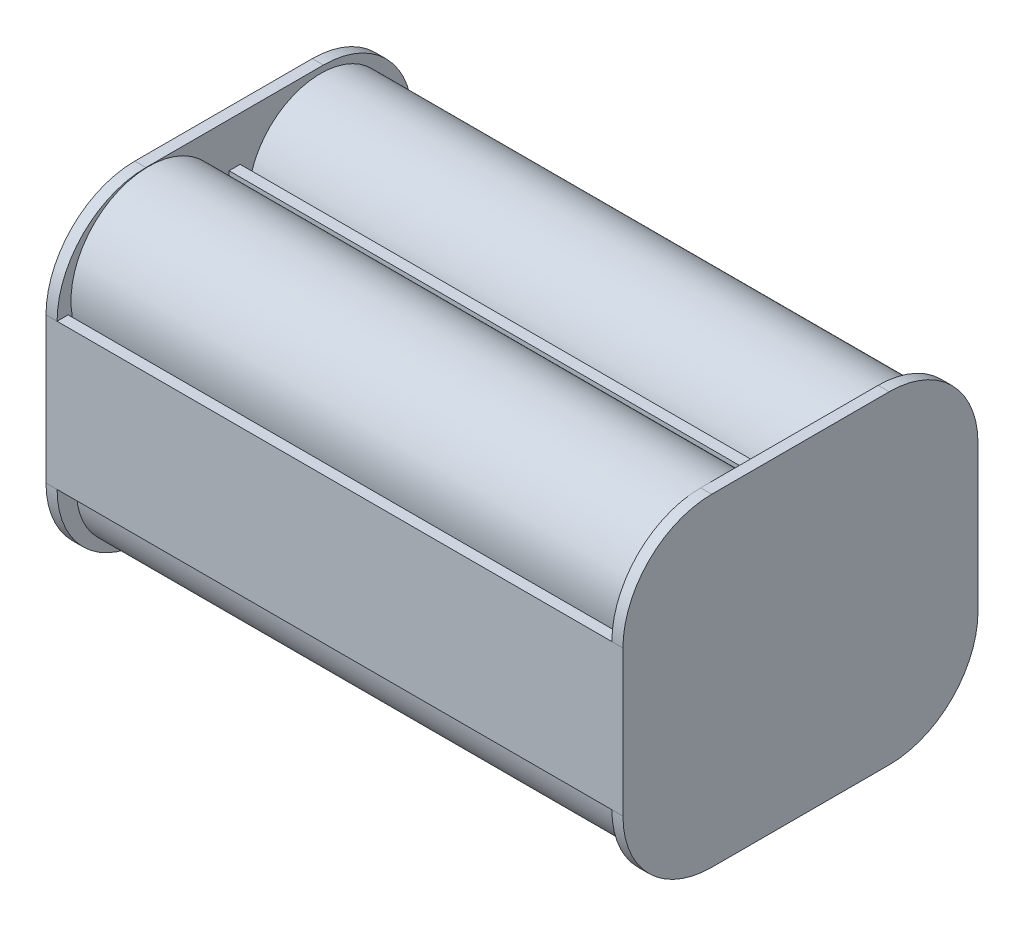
from build123d import *

# Parameters (mm, degrees)
RESSALTO_EXTRUS_O1_DEPTH  = 1
RESSALTO_EXTRUS_O2_DEPTH  = 50
ESBO_O3_R                 = 7
RESSALTO_EXTRUS_O5_DEPTH  = 50
ESBO_O7_R                 = 6.5
RESSALTO_EXTRUS_O9_DEPTH  = 50
ESBO_O8_R                 = 6.5
RESSALTO_EXTRUS_O10_DEPTH = 50
ESBO_O9_R                 = 6.5
RESSALTO_EXTRUS_O11_DEPTH = 50
RESSALTO_EXTRUS_O12_DEPTH = 1


with BuildPart() as part:
    # Esbo_o1 → Ressalto-extrus_o1 (new body)
    with BuildSketch(Plane(origin=(0, 0, 0), x_dir=(0, 0, -1), z_dir=(1, 0, 0))):
        with BuildLine():
            Line((-5.303370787, 18.696629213), (10.696629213, 18.696629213))
            ThreePointArc((10.696629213, 18.696629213), (16.353483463, 16.353483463), (18.696629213, 10.696629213))
            Line((18.696629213, 10.696629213), (18.696629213, -2.426966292))
            ThreePointArc((18.696629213, -2.426966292), (16.353483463, -8.083820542), (10.696629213, -10.426966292))
            Line((10.696629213, -10.426966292), (-5.303370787, -10.426966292))
            ThreePointArc((-5.303370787, -10.426966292), (-10.960225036, -8.083820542), (-13.303370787, -2.426966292))
            Line((-13.303370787, -2.426966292), (-13.303370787, 10.696629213))
            ThreePointArc((-13.303370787, 10.696629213), (-10.960225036, 16.353483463), (-5.303370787, 18.696629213))
        make_face()
    extrude(amount=RESSALTO_EXTRUS_O1_DEPTH)

    # Esbo_o2 → Ressalto-extrus_o2 (add)
    with BuildSketch(Plane(origin=(1, 0, 0), x_dir=(0, 0, -1), z_dir=(1, 0, 0))):
        Polygon((18.696629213, -2.426966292), (18.696629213, 4.134831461), (18.696629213, 4.634831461), (18.696629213, 10.696629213), (17.696629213, 10.696629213), (17.696629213, 4.634831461), (3.196629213, 4.634831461), (3.196629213, 14.696629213), (2.696629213, 14.696629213), (2.196629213, 14.696629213), (2.196629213, 4.634831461), (-12.303370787, 4.634831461), (-12.303370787, 10.696629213), (-13.303370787, 10.696629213), (-13.303370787, 4.634831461), (-13.303370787, 3.634831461), (-13.303370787, -2.426966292), (-12.303370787, -2.426966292), (-12.303370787, 3.634831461), (2.196629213, 3.634831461), (2.196629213, -6.426966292), (3.196629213, -6.426966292), (3.196629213, 3.634831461), (17.696629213, 3.634831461), (17.696629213, -2.426966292), align=None)
    extrude(amount=RESSALTO_EXTRUS_O2_DEPTH)

    # Esbo_o3 → Ressalto-extrus_o5 (add)
    with BuildSketch(Plane(origin=(1, 0, 0), x_dir=(0, 0, -1), z_dir=(1, 0, 0))):
        with Locations((-5.053370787, 11.665730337)):
            Circle(ESBO_O3_R)
    extrude(amount=RESSALTO_EXTRUS_O5_DEPTH)

    # Esbo_o7 → Ressalto-extrus_o9 (add)
    with BuildSketch(Plane(origin=(1, 0, 0), x_dir=(0, 0, -1), z_dir=(1, 0, 0))):
        with Locations((10.446629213, 11.665730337)):
            Circle(ESBO_O7_R)
    extrude(amount=RESSALTO_EXTRUS_O9_DEPTH)

    # Esbo_o8 → Ressalto-extrus_o10 (add)
    with BuildSketch(Plane(origin=(1, 0, 0), x_dir=(0, 0, -1), z_dir=(1, 0, 0))):
        with Locations((-5.053370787, -3.396067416)):
            Circle(ESBO_O8_R)
    extrude(amount=RESSALTO_EXTRUS_O10_DEPTH)

    # Esbo_o9 → Ressalto-extrus_o11 (add)
    with BuildSketch(Plane(origin=(1, 0, 0), x_dir=(0, 0, -1), z_dir=(1, 0, 0))):
        with Locations((10.446629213, -3.396067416)):
            Circle(ESBO_O9_R)
    extrude(amount=RESSALTO_EXTRUS_O11_DEPTH)

    # Esbo_o10 → Ressalto-extrus_o12 (add)
    with BuildSketch(Plane(origin=(51, 0, 0), x_dir=(0, 0, -1), z_dir=(1, 0, 0))):
        with BuildLine():
            Line((-5.303370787, -10.426966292), (10.696629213, -10.426966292))
            ThreePointArc((10.696629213, -10.426966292), (16.353483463, -8.083820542), (18.696629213, -2.426966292))
            Line((18.696629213, -2.426966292), (18.696629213, 10.696629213))
            ThreePointArc((18.696629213, 10.696629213), (16.353483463, 16.353483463), (10.696629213, 18.696629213))
            Line((10.696629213, 18.696629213), (-5.303370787, 18.696629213))
            ThreePointArc((-5.303370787, 18.696629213), (-10.960225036, 16.353483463), (-13.303370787, 10.696629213))
            Line((-13.303370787, 10.696629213), (-13.303370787, -2.426966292))
            ThreePointArc((-13.303370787, -2.426966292), (-10.960225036, -8.083820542), (-5.303370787, -10.426966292))
        make_face()
    extrude(amount=RESSALTO_EXTRUS_O12_DEPTH)


solid = part.part
